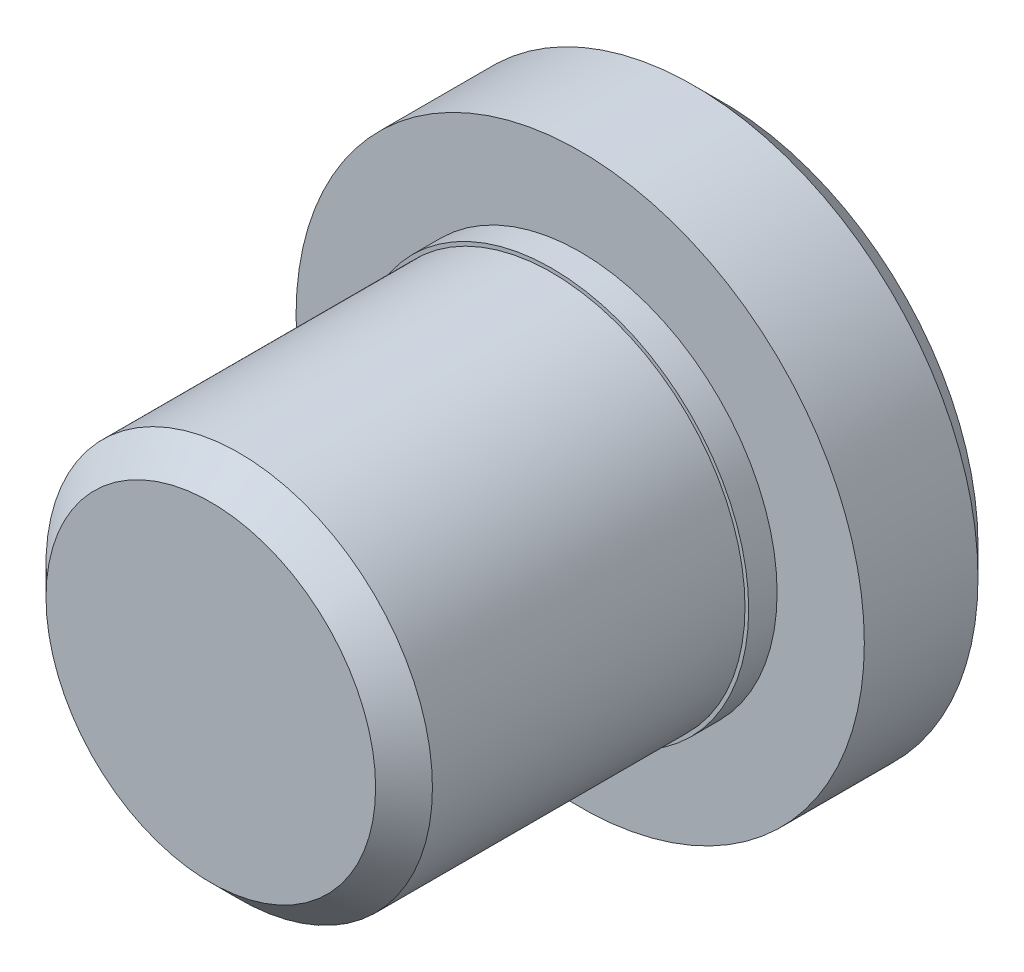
from build123d import *


with BuildPart() as part:
    # Schizzo1 → Rivoluzione1 (revolve)
    with BuildSketch(Plane(origin=(0, 0, 0), x_dir=(1, 0, 0), z_dir=(0, 1, 0))):
        Polygon((1.621, -7), (0, -7.935884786), (0, -9), (2.9, -9), (3.4, -8.5), (3.4, -3), (3.465, -3), (3.465, -2.5), (5, -2.5), (5, -0.5), (4.5, 0), (2, 0), (1.621, -0.379), align=None)
    revolve(axis=Axis((0, 0, 0), (0, 0, 1)))


solid = part.part
